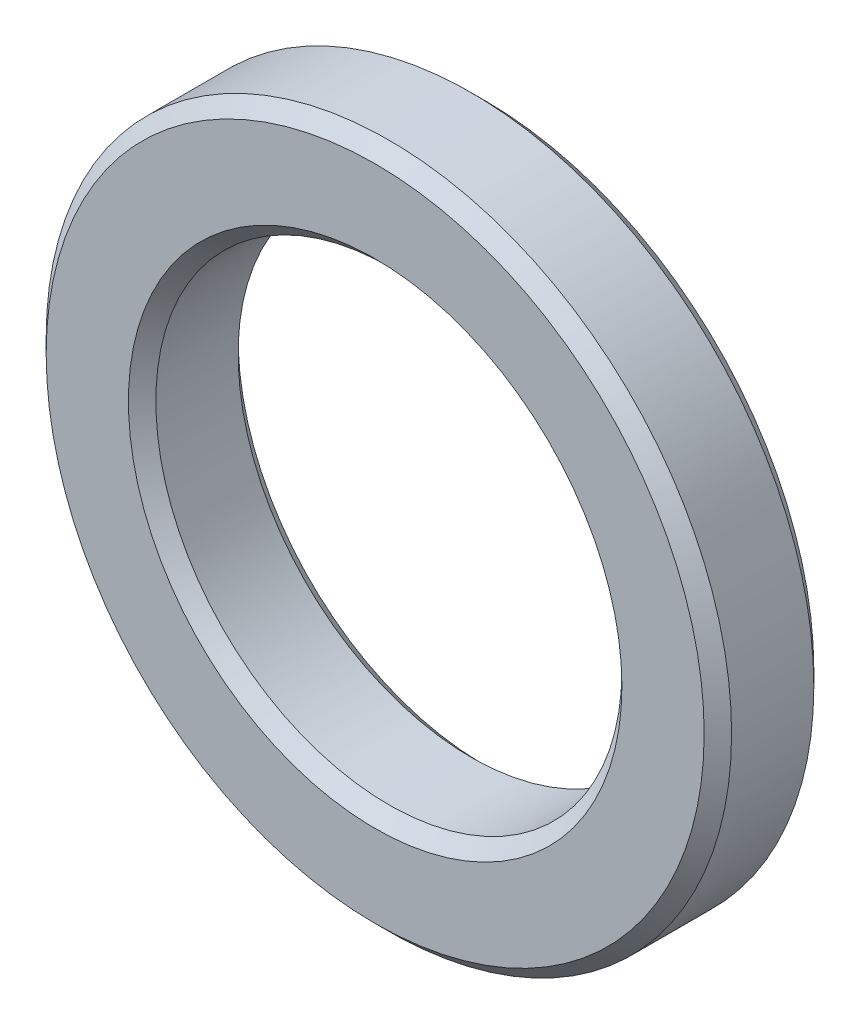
ISO-10303-21;
HEADER;
FILE_DESCRIPTION(('STEP AP214'),'2;1');
FILE_NAME('part.step','',(''),(''),'','','');
FILE_SCHEMA(('AUTOMOTIVE_DESIGN { 1 0 10303 214 1 1 1 1 }'));
ENDSEC;
DATA;
#1=APPLICATION_CONTEXT('core data for automotive mechanical design processes');
#2=APPLICATION_PROTOCOL_DEFINITION('international standard','automotive_design',2000,#1);
#3=PRODUCT_CONTEXT('',#1,'mechanical');
#4=PRODUCT('Part','Part','',(#3));
#5=PRODUCT_RELATED_PRODUCT_CATEGORY('part','',(#4));
#6=PRODUCT_DEFINITION_FORMATION('','',#4);
#7=PRODUCT_DEFINITION_CONTEXT('part definition',#1,'design');
#8=PRODUCT_DEFINITION('design','',#6,#7);
#9=PRODUCT_DEFINITION_SHAPE('','',#8);
#10=(LENGTH_UNIT() NAMED_UNIT(*) SI_UNIT(.MILLI.,.METRE.));
#11=(NAMED_UNIT(*) PLANE_ANGLE_UNIT() SI_UNIT($,.RADIAN.));
#12=(NAMED_UNIT(*) SI_UNIT($,.STERADIAN.) SOLID_ANGLE_UNIT());
#13=UNCERTAINTY_MEASURE_WITH_UNIT(LENGTH_MEASURE(1.E-05),#10,'distance_accuracy_value','');
#14=(GEOMETRIC_REPRESENTATION_CONTEXT(3) GLOBAL_UNCERTAINTY_ASSIGNED_CONTEXT((#13)) GLOBAL_UNIT_ASSIGNED_CONTEXT((#10,
#11,#12)) REPRESENTATION_CONTEXT('',''));
#15=CARTESIAN_POINT('',(0.,0.,0.));
#16=DIRECTION('',(0.,0.,1.));
#17=DIRECTION('',(1.,0.,0.));
#18=AXIS2_PLACEMENT_3D('',#15,#16,#17);
#19=CARTESIAN_POINT('',(0.,0.,4.));
#20=DIRECTION('',(0.,0.,1.));
#21=DIRECTION('',(1.,0.,0.));
#22=AXIS2_PLACEMENT_3D('',#19,#20,#21);
#23=PLANE('',#22);
#24=CARTESIAN_POINT('',(0.,0.,4.));
#25=DIRECTION('',(0.,0.,1.));
#26=DIRECTION('',(1.,0.,0.));
#27=AXIS2_PLACEMENT_3D('',#24,#25,#26);
#28=CIRCLE('',#27,9.);
#29=CARTESIAN_POINT('',(9.,0.,4.));
#30=VERTEX_POINT('',#29);
#31=EDGE_CURVE('E23',#30,#30,#28,.F.);
#32=ORIENTED_EDGE('',*,*,#31,.T.);
#33=EDGE_LOOP('',(#32));
#34=FACE_BOUND('',#33,.T.);
#35=CARTESIAN_POINT('',(0.,0.,4.));
#36=DIRECTION('',(0.,0.,1.));
#37=DIRECTION('',(1.,0.,0.));
#38=AXIS2_PLACEMENT_3D('',#35,#36,#37);
#39=CIRCLE('',#38,12.);
#40=CARTESIAN_POINT('',(12.,0.,4.));
#41=VERTEX_POINT('',#40);
#42=EDGE_CURVE('E27',#41,#41,#39,.T.);
#43=ORIENTED_EDGE('',*,*,#42,.T.);
#44=EDGE_LOOP('',(#43));
#45=FACE_BOUND('',#44,.T.);
#46=ADVANCED_FACE('F12',(#34,#45),#23,.T.);
#47=CARTESIAN_POINT('',(0.,0.,0.));
#48=DIRECTION('',(0.,0.,1.));
#49=DIRECTION('',(1.,0.,0.));
#50=AXIS2_PLACEMENT_3D('',#47,#48,#49);
#51=PLANE('',#50);
#52=CARTESIAN_POINT('',(0.,0.,0.));
#53=DIRECTION('',(0.,0.,1.));
#54=DIRECTION('',(1.,0.,0.));
#55=AXIS2_PLACEMENT_3D('',#52,#53,#54);
#56=CIRCLE('',#55,9.);
#57=CARTESIAN_POINT('',(9.,0.,0.));
#58=VERTEX_POINT('',#57);
#59=EDGE_CURVE('E38',#58,#58,#56,.T.);
#60=ORIENTED_EDGE('',*,*,#59,.T.);
#61=EDGE_LOOP('',(#60));
#62=FACE_BOUND('',#61,.T.);
#63=CARTESIAN_POINT('',(0.,0.,0.));
#64=DIRECTION('',(0.,0.,1.));
#65=DIRECTION('',(1.,0.,0.));
#66=AXIS2_PLACEMENT_3D('',#63,#64,#65);
#67=CIRCLE('',#66,12.);
#68=CARTESIAN_POINT('',(12.,0.,0.));
#69=VERTEX_POINT('',#68);
#70=EDGE_CURVE('E41',#69,#69,#67,.F.);
#71=ORIENTED_EDGE('',*,*,#70,.T.);
#72=EDGE_LOOP('',(#71));
#73=FACE_BOUND('',#72,.T.);
#74=ADVANCED_FACE('F45',(#62,#73),#51,.F.);
#75=CARTESIAN_POINT('',(0.,0.,4.));
#76=DIRECTION('',(0.,0.,-1.));
#77=DIRECTION('',(-1.,0.,0.));
#78=AXIS2_PLACEMENT_3D('',#75,#76,#77);
#79=CYLINDRICAL_SURFACE('',#78,12.5);
#80=CARTESIAN_POINT('',(0.,0.,0.5));
#81=DIRECTION('',(0.,0.,1.));
#82=DIRECTION('',(1.,0.,0.));
#83=AXIS2_PLACEMENT_3D('',#80,#81,#82);
#84=CIRCLE('',#83,12.5);
#85=CARTESIAN_POINT('',(12.5,0.,0.5));
#86=VERTEX_POINT('',#85);
#87=EDGE_CURVE('E8',#86,#86,#84,.T.);
#88=ORIENTED_EDGE('',*,*,#87,.T.);
#89=EDGE_LOOP('',(#88));
#90=FACE_BOUND('',#89,.T.);
#91=CARTESIAN_POINT('',(0.,0.,3.5));
#92=DIRECTION('',(0.,0.,1.));
#93=DIRECTION('',(1.,0.,0.));
#94=AXIS2_PLACEMENT_3D('',#91,#92,#93);
#95=CIRCLE('',#94,12.5);
#96=CARTESIAN_POINT('',(12.5,0.,3.5));
#97=VERTEX_POINT('',#96);
#98=EDGE_CURVE('E19',#97,#97,#95,.F.);
#99=ORIENTED_EDGE('',*,*,#98,.T.);
#100=EDGE_LOOP('',(#99));
#101=FACE_BOUND('',#100,.T.);
#102=ADVANCED_FACE('F68',(#90,#101),#79,.T.);
#103=CARTESIAN_POINT('',(0.,0.,4.));
#104=DIRECTION('',(0.,0.,-1.));
#105=DIRECTION('',(-1.,0.,0.));
#106=AXIS2_PLACEMENT_3D('',#103,#104,#105);
#107=CYLINDRICAL_SURFACE('',#106,8.5);
#108=CARTESIAN_POINT('',(0.,0.,0.5));
#109=DIRECTION('',(0.,0.,1.));
#110=DIRECTION('',(1.,0.,0.));
#111=AXIS2_PLACEMENT_3D('',#108,#109,#110);
#112=CIRCLE('',#111,8.5);
#113=CARTESIAN_POINT('',(8.5,0.,0.5));
#114=VERTEX_POINT('',#113);
#115=EDGE_CURVE('E32',#114,#114,#112,.F.);
#116=ORIENTED_EDGE('',*,*,#115,.T.);
#117=EDGE_LOOP('',(#116));
#118=FACE_BOUND('',#117,.T.);
#119=CARTESIAN_POINT('',(0.,0.,3.5));
#120=DIRECTION('',(0.,0.,1.));
#121=DIRECTION('',(1.,0.,0.));
#122=AXIS2_PLACEMENT_3D('',#119,#120,#121);
#123=CIRCLE('',#122,8.5);
#124=CARTESIAN_POINT('',(8.5,0.,3.5));
#125=VERTEX_POINT('',#124);
#126=EDGE_CURVE('E35',#125,#125,#123,.T.);
#127=ORIENTED_EDGE('',*,*,#126,.T.);
#128=EDGE_LOOP('',(#127));
#129=FACE_BOUND('',#128,.T.);
#130=ADVANCED_FACE('F76',(#118,#129),#107,.F.);
#131=CARTESIAN_POINT('',(0.,0.,0.));
#132=DIRECTION('',(0.,0.,-1.));
#133=DIRECTION('',(-1.,0.,0.));
#134=AXIS2_PLACEMENT_3D('',#131,#132,#133);
#135=CONICAL_SURFACE('',#134,9.,0.78539816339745);
#136=ORIENTED_EDGE('',*,*,#115,.F.);
#137=EDGE_LOOP('',(#136));
#138=FACE_BOUND('',#137,.T.);
#139=ORIENTED_EDGE('',*,*,#59,.F.);
#140=EDGE_LOOP('',(#139));
#141=FACE_BOUND('',#140,.T.);
#142=ADVANCED_FACE('F58',(#138,#141),#135,.F.);
#143=CARTESIAN_POINT('',(0.,0.,3.5));
#144=DIRECTION('',(0.,0.,1.));
#145=DIRECTION('',(1.,0.,0.));
#146=AXIS2_PLACEMENT_3D('',#143,#144,#145);
#147=CONICAL_SURFACE('',#146,8.5,0.78539816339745);
#148=ORIENTED_EDGE('',*,*,#31,.F.);
#149=EDGE_LOOP('',(#148));
#150=FACE_BOUND('',#149,.T.);
#151=ORIENTED_EDGE('',*,*,#126,.F.);
#152=EDGE_LOOP('',(#151));
#153=FACE_BOUND('',#152,.T.);
#154=ADVANCED_FACE('F50',(#150,#153),#147,.F.);
#155=CARTESIAN_POINT('',(0.,0.,0.5));
#156=DIRECTION('',(0.,0.,1.));
#157=DIRECTION('',(1.,0.,0.));
#158=AXIS2_PLACEMENT_3D('',#155,#156,#157);
#159=CONICAL_SURFACE('',#158,12.5,0.78539816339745);
#160=ORIENTED_EDGE('',*,*,#70,.F.);
#161=EDGE_LOOP('',(#160));
#162=FACE_BOUND('',#161,.T.);
#163=ORIENTED_EDGE('',*,*,#87,.F.);
#164=EDGE_LOOP('',(#163));
#165=FACE_BOUND('',#164,.T.);
#166=ADVANCED_FACE('F47',(#162,#165),#159,.T.);
#167=CARTESIAN_POINT('',(0.,0.,4.));
#168=DIRECTION('',(0.,0.,-1.));
#169=DIRECTION('',(-1.,0.,0.));
#170=AXIS2_PLACEMENT_3D('',#167,#168,#169);
#171=CONICAL_SURFACE('',#170,12.,0.78539816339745);
#172=ORIENTED_EDGE('',*,*,#98,.F.);
#173=EDGE_LOOP('',(#172));
#174=FACE_BOUND('',#173,.T.);
#175=ORIENTED_EDGE('',*,*,#42,.F.);
#176=EDGE_LOOP('',(#175));
#177=FACE_BOUND('',#176,.T.);
#178=ADVANCED_FACE('F14',(#174,#177),#171,.T.);
#179=CLOSED_SHELL('',(#46,#74,#102,#130,#142,#154,#166,#178));
#180=MANIFOLD_SOLID_BREP('B1',#179);
#181=ADVANCED_BREP_SHAPE_REPRESENTATION('',(#18,#180),#14);
#182=SHAPE_DEFINITION_REPRESENTATION(#9,#181);
ENDSEC;
END-ISO-10303-21;
